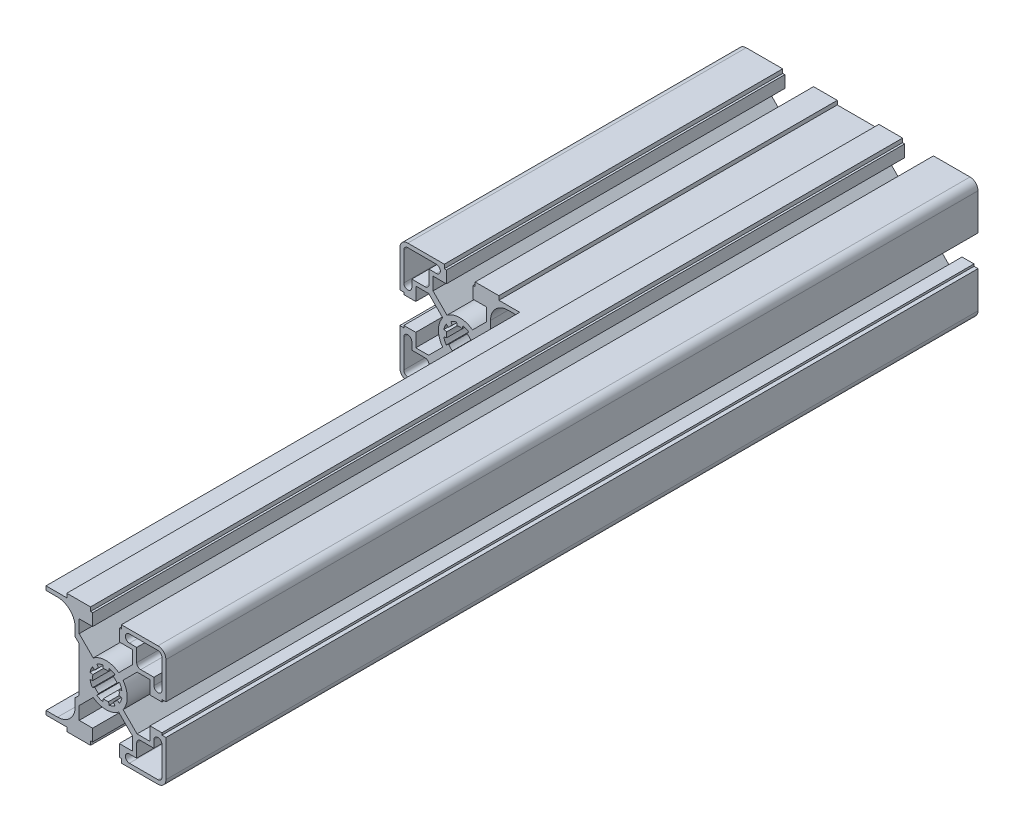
from build123d import *

# Parameters (mm, degrees)
BOSS_EXTRUDE1_DEPTH = 152.4
SKETCH2_W           = 45.0088
SKETCH2_H           = 45.0088
CUT_EXTRUDE1_DEPTH  = 177.8


with BuildPart() as part:
    # Sketch1 → Boss-Extrude1 (new, symmetric)
    with BuildSketch(Plane.XY):
        with BuildLine():
            Line((-42.0116, 22.5044), (-28.2956, 22.5044))
            Line((-28.2956, 22.5044), (-28.2956, 21.0058))
            Line((-28.2956, 21.0058), (-27.5082, 21.0058))
            Line((-27.5082, 21.0058), (-27.5082, 16.51))
            Line((-27.5082, 16.51), (-32.5501, 16.51))
            Line((-32.5501, 16.51), (-32.5501, 11.680106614))
            Line((-32.5501, 11.680106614), (-27.285426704, 6.415433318))
            ThreePointArc((-27.285426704, 6.415433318), (-22.5044, 8.001), (-17.723373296, 6.415433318))
            Line((-17.723373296, 6.415433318), (-12.4587, 11.680106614))
            Line((-12.4587, 11.680106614), (-12.4587, 16.51))
            Line((-12.4587, 16.51), (-17.5006, 16.51))
            Line((-17.5006, 16.51), (-17.5006, 21.0058))
            Line((-17.5006, 21.0058), (-16.7132, 21.0058))
            Line((-16.7132, 21.0058), (-16.7132, 22.5044))
            Line((-16.7132, 22.5044), (-7.8105, 22.5044))
            Line((-7.8105, 22.5044), (-7.8105, 21.0058))
            Line((-7.8105, 21.0058), (7.8105, 21.0058))
            Line((7.8105, 21.0058), (7.8105, 22.5044))
            Line((7.8105, 22.5044), (16.7132, 22.5044))
            Line((16.7132, 22.5044), (16.7132, 21.0058))
            Line((16.7132, 21.0058), (17.5006, 21.0058))
            Line((17.5006, 21.0058), (17.5006, 16.51))
            Line((17.5006, 16.51), (12.4587, 16.51))
            Line((12.4587, 16.51), (12.4587, 11.680106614))
            Line((12.4587, 11.680106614), (17.723373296, 6.415433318))
            ThreePointArc((17.723373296, 6.415433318), (22.5044, 8.001), (27.285426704, 6.415433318))
            Line((27.285426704, 6.415433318), (32.5501, 11.680106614))
            Line((32.5501, 11.680106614), (32.5501, 16.51))
            Line((32.5501, 16.51), (27.5082, 16.51))
            Line((27.5082, 16.51), (27.5082, 21.0058))
            Line((27.5082, 21.0058), (28.2956, 21.0058))
            Line((28.2956, 21.0058), (28.2956, 22.5044))
            Line((28.2956, 22.5044), (42.0116, 22.5044))
            ThreePointArc((42.0116, 22.5044), (44.130940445, 21.626540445), (45.0088, 19.5072))
            Line((45.0088, 19.5072), (45.0088, 5.7912))
            Line((45.0088, 5.7912), (43.5102, 5.7912))
            Line((43.5102, 5.7912), (43.5102, 5.0038))
            Line((43.5102, 5.0038), (39.0144, 5.0038))
            Line((39.0144, 5.0038), (39.0144, 10.0457))
            Line((39.0144, 10.0457), (34.184506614, 10.0457))
            Line((34.184506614, 10.0457), (28.919833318, 4.781026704))
            ThreePointArc((28.919833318, 4.781026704), (30.5054, 0), (28.919833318, -4.781026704))
            Line((28.919833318, -4.781026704), (34.184506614, -10.0457))
            Line((34.184506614, -10.0457), (39.0144, -10.0457))
            Line((39.0144, -10.0457), (39.0144, -5.0038))
            Line((39.0144, -5.0038), (43.5102, -5.0038))
            Line((43.5102, -5.0038), (43.5102, -5.7912))
            Line((43.5102, -5.7912), (45.0088, -5.7912))
            Line((45.0088, -5.7912), (45.0088, -19.5072))
            ThreePointArc((45.0088, -19.5072), (44.130940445, -21.626540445), (42.0116, -22.5044))
            Line((42.0116, -22.5044), (28.2956, -22.5044))
            Line((28.2956, -22.5044), (28.2956, -21.0058))
            Line((28.2956, -21.0058), (27.5082, -21.0058))
            Line((27.5082, -21.0058), (27.5082, -16.51))
            Line((27.5082, -16.51), (32.5501, -16.51))
            Line((32.5501, -16.51), (32.5501, -11.680106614))
            Line((32.5501, -11.680106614), (27.285426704, -6.415433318))
            ThreePointArc((27.285426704, -6.415433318), (22.5044, -8.001), (17.723373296, -6.415433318))
            Line((17.723373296, -6.415433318), (12.4587, -11.680106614))
            Line((12.4587, -11.680106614), (12.4587, -16.51))
            Line((12.4587, -16.51), (17.5006, -16.51))
            Line((17.5006, -16.51), (17.5006, -21.0058))
            Line((17.5006, -21.0058), (16.7132, -21.0058))
            Line((16.7132, -21.0058), (16.7132, -22.5044))
            Line((16.7132, -22.5044), (7.8105, -22.5044))
            Line((7.8105, -22.5044), (7.8105, -21.0058))
            Line((7.8105, -21.0058), (-7.8105, -21.0058))
            Line((-7.8105, -21.0058), (-7.8105, -22.5044))
            Line((-7.8105, -22.5044), (-16.7132, -22.5044))
            Line((-16.7132, -22.5044), (-16.7132, -21.0058))
            Line((-16.7132, -21.0058), (-17.5006, -21.0058))
            Line((-17.5006, -21.0058), (-17.5006, -16.51))
            Line((-17.5006, -16.51), (-12.4587, -16.51))
            Line((-12.4587, -16.51), (-12.4587, -11.680106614))
            Line((-12.4587, -11.680106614), (-17.723373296, -6.415433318))
            ThreePointArc((-17.723373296, -6.415433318), (-22.5044, -8.001), (-27.285426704, -6.415433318))
            Line((-27.285426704, -6.415433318), (-32.5501, -11.680106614))
            Line((-32.5501, -11.680106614), (-32.5501, -16.51))
            Line((-32.5501, -16.51), (-27.5082, -16.51))
            Line((-27.5082, -16.51), (-27.5082, -21.0058))
            Line((-27.5082, -21.0058), (-28.2956, -21.0058))
            Line((-28.2956, -21.0058), (-28.2956, -22.5044))
            Line((-28.2956, -22.5044), (-42.0116, -22.5044))
            ThreePointArc((-42.0116, -22.5044), (-44.130940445, -21.626540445), (-45.0088, -19.5072))
            Line((-45.0088, -19.5072), (-45.0088, -5.7912))
            Line((-45.0088, -5.7912), (-43.5102, -5.7912))
            Line((-43.5102, -5.7912), (-43.5102, -5.0038))
            Line((-43.5102, -5.0038), (-39.0144, -5.0038))
            Line((-39.0144, -5.0038), (-39.0144, -10.0457))
            Line((-39.0144, -10.0457), (-34.184506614, -10.0457))
            Line((-34.184506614, -10.0457), (-28.919833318, -4.781026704))
            ThreePointArc((-28.919833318, -4.781026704), (-30.5054, 0), (-28.919833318, 4.781026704))
            Line((-28.919833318, 4.781026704), (-34.184506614, 10.0457))
            Line((-34.184506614, 10.0457), (-39.0144, 10.0457))
            Line((-39.0144, 10.0457), (-39.0144, 5.0038))
            Line((-39.0144, 5.0038), (-43.5102, 5.0038))
            Line((-43.5102, 5.0038), (-43.5102, 5.7912))
            Line((-43.5102, 5.7912), (-45.0088, 5.7912))
            Line((-45.0088, 5.7912), (-45.0088, 19.5072))
            ThreePointArc((-45.0088, 19.5072), (-44.130940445, 21.626540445), (-42.0116, 22.5044))
        make_face()
        with BuildLine():
            Line((-40.513, 11.5443), (-35.5473, 11.5443))
            ThreePointArc((-35.5473, 11.5443), (-34.487629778, 11.983229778), (-34.0487, 13.0429))
            Line((-34.0487, 13.0429), (-34.0487, 18.0086))
            Line((-34.0487, 18.0086), (-31.2928, 18.0086))
            ThreePointArc((-31.2928, 18.0086), (-29.7942, 19.5072), (-31.2928, 21.0058))
            Line((-31.2928, 21.0058), (-42.0116, 21.0058))
            ThreePointArc((-42.0116, 21.0058), (-43.071270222, 20.566870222), (-43.5102, 19.5072))
            Line((-43.5102, 19.5072), (-43.5102, 8.7884))
            ThreePointArc((-43.5102, 8.7884), (-42.0116, 7.2898), (-40.513, 8.7884))
            Line((-40.513, 8.7884), (-40.513, 11.5443))
        make_face(mode=Mode.SUBTRACT)
        with BuildLine():
            Line((-21.315129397, 5.978867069), (-21.528207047, 4.907653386))
            ThreePointArc((-21.528207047, 4.907653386), (-22.5044, 5.0038), (-23.480592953, 4.907653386))
            Line((-23.480592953, 4.907653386), (-23.693670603, 5.978867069))
            ThreePointArc((-23.693670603, 5.978867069), (-24.837238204, 5.63196963), (-25.89115614, 5.068638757))
            Line((-25.89115614, 5.068638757), (-25.284362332, 4.160507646))
            ThreePointArc((-25.284362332, 4.160507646), (-26.042620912, 3.538220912), (-26.664907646, 2.779962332))
            Line((-26.664907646, 2.779962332), (-27.573038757, 3.38675614))
            ThreePointArc((-27.573038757, 3.38675614), (-28.13636963, 2.332838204), (-28.483267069, 1.189270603))
            Line((-28.483267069, 1.189270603), (-27.412053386, 0.976192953))
            ThreePointArc((-27.412053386, 0.976192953), (-27.5082, 0), (-27.412053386, -0.976192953))
            Line((-27.412053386, -0.976192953), (-28.483267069, -1.189270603))
            ThreePointArc((-28.483267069, -1.189270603), (-28.13636963, -2.332838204), (-27.573038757, -3.38675614))
            Line((-27.573038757, -3.38675614), (-26.664907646, -2.779962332))
            ThreePointArc((-26.664907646, -2.779962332), (-26.042620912, -3.538220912), (-25.284362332, -4.160507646))
            Line((-25.284362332, -4.160507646), (-25.89115614, -5.068638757))
            ThreePointArc((-25.89115614, -5.068638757), (-24.837238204, -5.63196963), (-23.693670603, -5.978867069))
            Line((-23.693670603, -5.978867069), (-23.480592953, -4.907653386))
            ThreePointArc((-23.480592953, -4.907653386), (-22.5044, -5.0038), (-21.528207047, -4.907653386))
            Line((-21.528207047, -4.907653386), (-21.315129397, -5.978867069))
            ThreePointArc((-21.315129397, -5.978867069), (-20.171561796, -5.63196963), (-19.11764386, -5.068638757))
            Line((-19.11764386, -5.068638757), (-19.724437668, -4.160507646))
            ThreePointArc((-19.724437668, -4.160507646), (-18.966179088, -3.538220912), (-18.343892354, -2.779962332))
            Line((-18.343892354, -2.779962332), (-17.435761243, -3.38675614))
            ThreePointArc((-17.435761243, -3.38675614), (-16.87243037, -2.332838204), (-16.525532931, -1.189270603))
            Line((-16.525532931, -1.189270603), (-17.596746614, -0.976192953))
            ThreePointArc((-17.596746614, -0.976192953), (-17.5006, 0), (-17.596746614, 0.976192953))
            Line((-17.596746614, 0.976192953), (-16.525532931, 1.189270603))
            ThreePointArc((-16.525532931, 1.189270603), (-16.87243037, 2.332838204), (-17.435761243, 3.38675614))
            Line((-17.435761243, 3.38675614), (-18.343892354, 2.779962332))
            ThreePointArc((-18.343892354, 2.779962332), (-18.966179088, 3.538220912), (-19.724437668, 4.160507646))
            Line((-19.724437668, 4.160507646), (-19.11764386, 5.068638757))
            ThreePointArc((-19.11764386, 5.068638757), (-20.171561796, 5.63196963), (-21.315129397, 5.978867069))
        make_face(mode=Mode.SUBTRACT)
        with BuildLine():
            Line((-10.9601, 9.909893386), (-12.4587, 8.411293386))
            Line((-12.4587, 8.411293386), (-12.4587, -8.411293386))
            Line((-12.4587, -8.411293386), (-10.9601, -9.909893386))
            Line((-10.9601, -9.909893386), (-10.9601, -12.9032))
            ThreePointArc((-10.9601, -12.9032), (-9.025833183, -17.572933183), (-4.3561, -19.5072))
            Line((-4.3561, -19.5072), (4.3561, -19.5072))
            ThreePointArc((4.3561, -19.5072), (9.025833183, -17.572933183), (10.9601, -12.9032))
            Line((10.9601, -12.9032), (10.9601, -9.909893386))
            Line((10.9601, -9.909893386), (12.4587, -8.411293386))
            Line((12.4587, -8.411293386), (12.4587, 8.411293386))
            Line((12.4587, 8.411293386), (10.9601, 9.909893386))
            Line((10.9601, 9.909893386), (10.9601, 12.9032))
            ThreePointArc((10.9601, 12.9032), (9.025833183, 17.572933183), (4.3561, 19.5072))
            Line((4.3561, 19.5072), (-4.3561, 19.5072))
            ThreePointArc((-4.3561, 19.5072), (-9.025833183, 17.572933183), (-10.9601, 12.9032))
            Line((-10.9601, 12.9032), (-10.9601, 9.909893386))
        make_face(mode=Mode.SUBTRACT)
        with BuildLine():
            Line((-40.513, -11.5443), (-35.5473, -11.5443))
            ThreePointArc((-35.5473, -11.5443), (-34.487629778, -11.983229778), (-34.0487, -13.0429))
            Line((-34.0487, -13.0429), (-34.0487, -18.0086))
            Line((-34.0487, -18.0086), (-31.2928, -18.0086))
            ThreePointArc((-31.2928, -18.0086), (-29.7942, -19.5072), (-31.2928, -21.0058))
            Line((-31.2928, -21.0058), (-42.0116, -21.0058))
            ThreePointArc((-42.0116, -21.0058), (-43.071270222, -20.566870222), (-43.5102, -19.5072))
            Line((-43.5102, -19.5072), (-43.5102, -8.7884))
            ThreePointArc((-43.5102, -8.7884), (-42.0116, -7.2898), (-40.513, -8.7884))
            Line((-40.513, -8.7884), (-40.513, -11.5443))
        make_face(mode=Mode.SUBTRACT)
        with BuildLine():
            Line((42.0116, 21.0058), (31.2928, 21.0058))
            ThreePointArc((31.2928, 21.0058), (29.7942, 19.5072), (31.2928, 18.0086))
            Line((31.2928, 18.0086), (34.0487, 18.0086))
            Line((34.0487, 18.0086), (34.0487, 13.0429))
            ThreePointArc((34.0487, 13.0429), (34.487629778, 11.983229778), (35.5473, 11.5443))
            Line((35.5473, 11.5443), (40.513, 11.5443))
            Line((40.513, 11.5443), (40.513, 8.7884))
            ThreePointArc((40.513, 8.7884), (42.0116, 7.2898), (43.5102, 8.7884))
            Line((43.5102, 8.7884), (43.5102, 19.5072))
            ThreePointArc((43.5102, 19.5072), (43.071270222, 20.566870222), (42.0116, 21.0058))
        make_face(mode=Mode.SUBTRACT)
        with BuildLine():
            Line((40.513, -11.5443), (35.5473, -11.5443))
            ThreePointArc((35.5473, -11.5443), (34.487629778, -11.983229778), (34.0487, -13.0429))
            Line((34.0487, -13.0429), (34.0487, -18.0086))
            Line((34.0487, -18.0086), (31.2928, -18.0086))
            ThreePointArc((31.2928, -18.0086), (29.7942, -19.5072), (31.2928, -21.0058))
            Line((31.2928, -21.0058), (42.0116, -21.0058))
            ThreePointArc((42.0116, -21.0058), (43.071270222, -20.566870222), (43.5102, -19.5072))
            Line((43.5102, -19.5072), (43.5102, -8.7884))
            ThreePointArc((43.5102, -8.7884), (42.0116, -7.2898), (40.513, -8.7884))
            Line((40.513, -8.7884), (40.513, -11.5443))
        make_face(mode=Mode.SUBTRACT)
        with BuildLine():
            Line((27.573038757, 3.38675614), (26.664907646, 2.779962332))
            ThreePointArc((26.664907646, 2.779962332), (26.042620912, 3.538220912), (25.284362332, 4.160507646))
            Line((25.284362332, 4.160507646), (25.89115614, 5.068638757))
            ThreePointArc((25.89115614, 5.068638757), (24.837238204, 5.63196963), (23.693670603, 5.978867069))
            Line((23.693670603, 5.978867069), (23.480592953, 4.907653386))
            ThreePointArc((23.480592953, 4.907653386), (22.5044, 5.0038), (21.528207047, 4.907653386))
            Line((21.528207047, 4.907653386), (21.315129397, 5.978867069))
            ThreePointArc((21.315129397, 5.978867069), (20.171561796, 5.63196963), (19.11764386, 5.068638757))
            Line((19.11764386, 5.068638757), (19.724437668, 4.160507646))
            ThreePointArc((19.724437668, 4.160507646), (18.966179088, 3.538220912), (18.343892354, 2.779962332))
            Line((18.343892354, 2.779962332), (17.435761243, 3.38675614))
            ThreePointArc((17.435761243, 3.38675614), (16.87243037, 2.332838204), (16.525532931, 1.189270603))
            Line((16.525532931, 1.189270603), (17.596746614, 0.976192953))
            ThreePointArc((17.596746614, 0.976192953), (17.5006, 0), (17.596746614, -0.976192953))
            Line((17.596746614, -0.976192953), (16.525532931, -1.189270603))
            ThreePointArc((16.525532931, -1.189270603), (16.87243037, -2.332838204), (17.435761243, -3.38675614))
            Line((17.435761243, -3.38675614), (18.343892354, -2.779962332))
            ThreePointArc((18.343892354, -2.779962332), (18.966179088, -3.538220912), (19.724437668, -4.160507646))
            Line((19.724437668, -4.160507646), (19.11764386, -5.068638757))
            ThreePointArc((19.11764386, -5.068638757), (20.171561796, -5.63196963), (21.315129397, -5.978867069))
            Line((21.315129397, -5.978867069), (21.528207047, -4.907653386))
            ThreePointArc((21.528207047, -4.907653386), (22.5044, -5.0038), (23.480592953, -4.907653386))
            Line((23.480592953, -4.907653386), (23.693670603, -5.978867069))
            ThreePointArc((23.693670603, -5.978867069), (24.837238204, -5.63196963), (25.89115614, -5.068638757))
            Line((25.89115614, -5.068638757), (25.284362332, -4.160507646))
            ThreePointArc((25.284362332, -4.160507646), (26.042620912, -3.538220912), (26.664907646, -2.779962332))
            Line((26.664907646, -2.779962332), (27.573038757, -3.38675614))
            ThreePointArc((27.573038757, -3.38675614), (28.13636963, -2.332838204), (28.483267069, -1.189270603))
            Line((28.483267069, -1.189270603), (27.412053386, -0.976192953))
            ThreePointArc((27.412053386, -0.976192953), (27.5082, 0), (27.412053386, 0.976192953))
            Line((27.412053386, 0.976192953), (28.483267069, 1.189270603))
            ThreePointArc((28.483267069, 1.189270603), (28.13636963, 2.332838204), (27.573038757, 3.38675614))
        make_face(mode=Mode.SUBTRACT)
    extrude(amount=BOSS_EXTRUDE1_DEPTH, both=True)

    # Sketch2 → Cut-Extrude1 (cut)
    with BuildSketch(Plane.XY.offset(152.4)):
        with Locations((-22.5044, 0)):
            Rectangle(SKETCH2_W, SKETCH2_H)
    extrude(amount=-CUT_EXTRUDE1_DEPTH, mode=Mode.SUBTRACT)


solid = part.part
